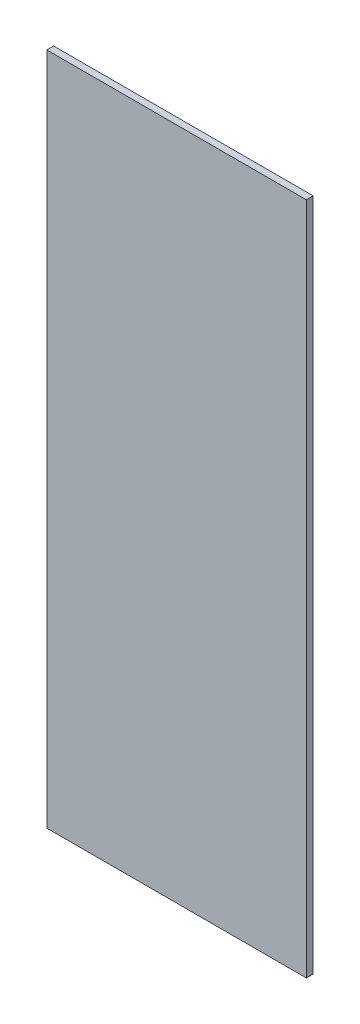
from build123d import *

# Parameters (mm, degrees)
CROQUIS1_W              = 570
CROQUIS1_H              = 1480
SALIENTE_EXTRUIR1_DEPTH = 15


with BuildPart() as part:
    # Croquis1 → Saliente-Extruir1 (new body)
    with BuildSketch(Plane.XY):
        Rectangle(CROQUIS1_W, CROQUIS1_H)
    extrude(amount=SALIENTE_EXTRUIR1_DEPTH)


solid = part.part
